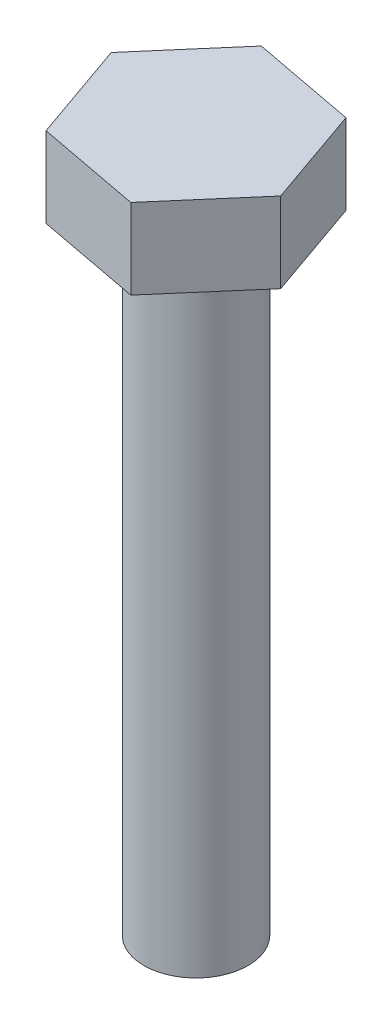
ISO-10303-21;
HEADER;
FILE_DESCRIPTION(('STEP AP214'),'2;1');
FILE_NAME('part.step','',(''),(''),'','','');
FILE_SCHEMA(('AUTOMOTIVE_DESIGN { 1 0 10303 214 1 1 1 1 }'));
ENDSEC;
DATA;
#1=APPLICATION_CONTEXT('core data for automotive mechanical design processes');
#2=APPLICATION_PROTOCOL_DEFINITION('international standard','automotive_design',2000,#1);
#3=PRODUCT_CONTEXT('',#1,'mechanical');
#4=PRODUCT('Part','Part','',(#3));
#5=PRODUCT_RELATED_PRODUCT_CATEGORY('part','',(#4));
#6=PRODUCT_DEFINITION_FORMATION('','',#4);
#7=PRODUCT_DEFINITION_CONTEXT('part definition',#1,'design');
#8=PRODUCT_DEFINITION('design','',#6,#7);
#9=PRODUCT_DEFINITION_SHAPE('','',#8);
#10=(LENGTH_UNIT() NAMED_UNIT(*) SI_UNIT(.MILLI.,.METRE.));
#11=(NAMED_UNIT(*) PLANE_ANGLE_UNIT() SI_UNIT($,.RADIAN.));
#12=(NAMED_UNIT(*) SI_UNIT($,.STERADIAN.) SOLID_ANGLE_UNIT());
#13=UNCERTAINTY_MEASURE_WITH_UNIT(LENGTH_MEASURE(1.E-05),#10,'distance_accuracy_value','');
#14=(GEOMETRIC_REPRESENTATION_CONTEXT(3) GLOBAL_UNCERTAINTY_ASSIGNED_CONTEXT((#13)) GLOBAL_UNIT_ASSIGNED_CONTEXT((#10,
#11,#12)) REPRESENTATION_CONTEXT('',''));
#15=CARTESIAN_POINT('',(0.,0.,0.));
#16=DIRECTION('',(0.,0.,1.));
#17=DIRECTION('',(1.,0.,0.));
#18=AXIS2_PLACEMENT_3D('',#15,#16,#17);
#19=CARTESIAN_POINT('',(0.,39.37,0.));
#20=DIRECTION('',(0.,1.,0.));
#21=DIRECTION('',(0.,0.,1.));
#22=AXIS2_PLACEMENT_3D('',#19,#20,#21);
#23=PLANE('',#22);
#24=DIRECTION('',(0.652264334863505,0.,-0.757991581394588));
#25=VECTOR('',#24,1.);
#26=CARTESIAN_POINT('',(-41.4810541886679,39.37,110.829527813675));
#27=LINE('',#26,#25);
#28=CARTESIAN_POINT('',(-41.4810541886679,39.37,110.829527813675));
#29=VERTEX_POINT('',#28);
#30=CARTESIAN_POINT('',(-37.0928819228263,39.37,105.730065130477));
#31=VERTEX_POINT('',#30);
#32=EDGE_CURVE('E119',#29,#31,#27,.T.);
#33=ORIENTED_EDGE('',*,*,#32,.F.);
#34=DIRECTION('',(0.982572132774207,0.,0.185881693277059));
#35=VECTOR('',#34,1.);
#36=CARTESIAN_POINT('',(-48.0914045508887,39.37,109.578990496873));
#37=LINE('',#36,#35);
#38=CARTESIAN_POINT('',(-48.0914045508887,39.37,109.578990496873));
#39=VERTEX_POINT('',#38);
#40=EDGE_CURVE('E79',#39,#29,#37,.T.);
#41=ORIENTED_EDGE('',*,*,#40,.F.);
#42=DIRECTION('',(0.330307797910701,0.,0.94387327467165));
#43=VECTOR('',#42,1.);
#44=CARTESIAN_POINT('',(-50.3135826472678,39.37,103.228990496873));
#45=LINE('',#44,#43);
#46=CARTESIAN_POINT('',(-50.3135826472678,39.37,103.228990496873));
#47=VERTEX_POINT('',#46);
#48=EDGE_CURVE('E73',#47,#39,#45,.T.);
#49=ORIENTED_EDGE('',*,*,#48,.F.);
#50=DIRECTION('',(-0.652264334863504,0.,0.757991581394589));
#51=VECTOR('',#50,1.);
#52=CARTESIAN_POINT('',(-45.9254103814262,39.37,98.1295278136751));
#53=LINE('',#52,#51);
#54=CARTESIAN_POINT('',(-45.9254103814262,39.37,98.1295278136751));
#55=VERTEX_POINT('',#54);
#56=EDGE_CURVE('E109',#55,#47,#53,.T.);
#57=ORIENTED_EDGE('',*,*,#56,.F.);
#58=DIRECTION('',(-0.982572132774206,0.,-0.185881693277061));
#59=VECTOR('',#58,1.);
#60=CARTESIAN_POINT('',(-39.3150600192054,39.37,99.3800651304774));
#61=LINE('',#60,#59);
#62=CARTESIAN_POINT('',(-39.3150600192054,39.37,99.3800651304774));
#63=VERTEX_POINT('',#62);
#64=EDGE_CURVE('E125',#63,#55,#61,.T.);
#65=ORIENTED_EDGE('',*,*,#64,.F.);
#66=DIRECTION('',(-0.330307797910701,0.,-0.94387327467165));
#67=VECTOR('',#66,1.);
#68=CARTESIAN_POINT('',(-37.0928819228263,39.37,105.730065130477));
#69=LINE('',#68,#67);
#70=EDGE_CURVE('E122',#31,#63,#69,.T.);
#71=ORIENTED_EDGE('',*,*,#70,.F.);
#72=EDGE_LOOP('',(#33,#41,#49,#57,#65,#71));
#73=FACE_BOUND('',#72,.T.);
#74=CARTESIAN_POINT('',(-43.7032322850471,39.37,104.479527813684));
#75=DIRECTION('',(0.,1.,0.));
#76=DIRECTION('',(0.,0.,1.));
#77=AXIS2_PLACEMENT_3D('',#74,#75,#76);
#78=CIRCLE('',#77,3.30000000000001);
#79=CARTESIAN_POINT('',(-43.7032322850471,39.37,107.779527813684));
#80=VERTEX_POINT('',#79);
#81=EDGE_CURVE('E11',#80,#80,#78,.F.);
#82=ORIENTED_EDGE('',*,*,#81,.F.);
#83=EDGE_LOOP('',(#82));
#84=FACE_BOUND('',#83,.T.);
#85=ADVANCED_FACE('F33',(#73,#84),#23,.F.);
#86=CARTESIAN_POINT('',(-41.4810541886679,44.45,110.829527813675));
#87=DIRECTION('',(-0.757991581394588,0.,-0.652264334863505));
#88=DIRECTION('',(-0.652264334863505,0.,0.757991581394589));
#89=AXIS2_PLACEMENT_3D('',#86,#87,#88);
#90=PLANE('',#89);
#91=ORIENTED_EDGE('',*,*,#32,.T.);
#92=DIRECTION('',(0.,-1.,0.));
#93=VECTOR('',#92,1.);
#94=CARTESIAN_POINT('',(-37.0928819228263,44.45,105.730065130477));
#95=LINE('',#94,#93);
#96=CARTESIAN_POINT('',(-37.0928819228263,44.45,105.730065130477));
#97=VERTEX_POINT('',#96);
#98=EDGE_CURVE('E42',#97,#31,#95,.T.);
#99=ORIENTED_EDGE('',*,*,#98,.F.);
#100=DIRECTION('',(0.652264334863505,0.,-0.757991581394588));
#101=VECTOR('',#100,1.);
#102=CARTESIAN_POINT('',(-41.4810541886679,44.45,110.829527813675));
#103=LINE('',#102,#101);
#104=CARTESIAN_POINT('',(-41.4810541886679,44.45,110.829527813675));
#105=VERTEX_POINT('',#104);
#106=EDGE_CURVE('E130',#105,#97,#103,.T.);
#107=ORIENTED_EDGE('',*,*,#106,.F.);
#108=DIRECTION('',(0.,-1.,0.));
#109=VECTOR('',#108,1.);
#110=CARTESIAN_POINT('',(-41.4810541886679,44.45,110.829527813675));
#111=LINE('',#110,#109);
#112=EDGE_CURVE('E115',#105,#29,#111,.T.);
#113=ORIENTED_EDGE('',*,*,#112,.T.);
#114=EDGE_LOOP('',(#91,#99,#107,#113));
#115=FACE_BOUND('',#114,.T.);
#116=ADVANCED_FACE('F35',(#115),#90,.F.);
#117=CARTESIAN_POINT('',(-37.0928819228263,44.45,105.730065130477));
#118=DIRECTION('',(-0.94387327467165,0.,0.330307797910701));
#119=DIRECTION('',(0.330307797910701,0.,0.94387327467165));
#120=AXIS2_PLACEMENT_3D('',#117,#118,#119);
#121=PLANE('',#120);
#122=ORIENTED_EDGE('',*,*,#70,.T.);
#123=DIRECTION('',(0.,-1.,0.));
#124=VECTOR('',#123,1.);
#125=CARTESIAN_POINT('',(-39.3150600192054,44.45,99.3800651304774));
#126=LINE('',#125,#124);
#127=CARTESIAN_POINT('',(-39.3150600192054,44.45,99.3800651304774));
#128=VERTEX_POINT('',#127);
#129=EDGE_CURVE('E134',#128,#63,#126,.T.);
#130=ORIENTED_EDGE('',*,*,#129,.F.);
#131=DIRECTION('',(-0.330307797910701,0.,-0.94387327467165));
#132=VECTOR('',#131,1.);
#133=CARTESIAN_POINT('',(-37.0928819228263,44.45,105.730065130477));
#134=LINE('',#133,#132);
#135=EDGE_CURVE('E88',#97,#128,#134,.T.);
#136=ORIENTED_EDGE('',*,*,#135,.F.);
#137=ORIENTED_EDGE('',*,*,#98,.T.);
#138=EDGE_LOOP('',(#122,#130,#136,#137));
#139=FACE_BOUND('',#138,.T.);
#140=ADVANCED_FACE('F137',(#139),#121,.F.);
#141=CARTESIAN_POINT('',(-39.3150600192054,44.45,99.3800651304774));
#142=DIRECTION('',(-0.185881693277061,0.,0.982572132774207));
#143=DIRECTION('',(0.982572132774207,0.,0.185881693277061));
#144=AXIS2_PLACEMENT_3D('',#141,#142,#143);
#145=PLANE('',#144);
#146=ORIENTED_EDGE('',*,*,#64,.T.);
#147=DIRECTION('',(0.,-1.,0.));
#148=VECTOR('',#147,1.);
#149=CARTESIAN_POINT('',(-45.9254103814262,44.45,98.1295278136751));
#150=LINE('',#149,#148);
#151=CARTESIAN_POINT('',(-45.9254103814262,44.45,98.1295278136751));
#152=VERTEX_POINT('',#151);
#153=EDGE_CURVE('E110',#152,#55,#150,.T.);
#154=ORIENTED_EDGE('',*,*,#153,.F.);
#155=DIRECTION('',(-0.982572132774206,0.,-0.185881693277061));
#156=VECTOR('',#155,1.);
#157=CARTESIAN_POINT('',(-39.3150600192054,44.45,99.3800651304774));
#158=LINE('',#157,#156);
#159=EDGE_CURVE('E101',#128,#152,#158,.T.);
#160=ORIENTED_EDGE('',*,*,#159,.F.);
#161=ORIENTED_EDGE('',*,*,#129,.T.);
#162=EDGE_LOOP('',(#146,#154,#160,#161));
#163=FACE_BOUND('',#162,.T.);
#164=ADVANCED_FACE('F145',(#163),#145,.F.);
#165=CARTESIAN_POINT('',(-45.9254103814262,44.45,98.1295278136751));
#166=DIRECTION('',(0.757991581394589,0.,0.652264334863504));
#167=DIRECTION('',(0.652264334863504,0.,-0.757991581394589));
#168=AXIS2_PLACEMENT_3D('',#165,#166,#167);
#169=PLANE('',#168);
#170=ORIENTED_EDGE('',*,*,#56,.T.);
#171=DIRECTION('',(0.,-1.,0.));
#172=VECTOR('',#171,1.);
#173=CARTESIAN_POINT('',(-50.3135826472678,44.45,103.228990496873));
#174=LINE('',#173,#172);
#175=CARTESIAN_POINT('',(-50.3135826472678,44.45,103.228990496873));
#176=VERTEX_POINT('',#175);
#177=EDGE_CURVE('E106',#176,#47,#174,.T.);
#178=ORIENTED_EDGE('',*,*,#177,.F.);
#179=DIRECTION('',(-0.652264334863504,0.,0.757991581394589));
#180=VECTOR('',#179,1.);
#181=CARTESIAN_POINT('',(-45.9254103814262,44.45,98.1295278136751));
#182=LINE('',#181,#180);
#183=EDGE_CURVE('E95',#152,#176,#182,.T.);
#184=ORIENTED_EDGE('',*,*,#183,.F.);
#185=ORIENTED_EDGE('',*,*,#153,.T.);
#186=EDGE_LOOP('',(#170,#178,#184,#185));
#187=FACE_BOUND('',#186,.T.);
#188=ADVANCED_FACE('F107',(#187),#169,.F.);
#189=CARTESIAN_POINT('',(-50.3135826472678,44.45,103.228990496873));
#190=DIRECTION('',(0.94387327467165,0.,-0.330307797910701));
#191=DIRECTION('',(-0.330307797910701,0.,-0.94387327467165));
#192=AXIS2_PLACEMENT_3D('',#189,#190,#191);
#193=PLANE('',#192);
#194=ORIENTED_EDGE('',*,*,#48,.T.);
#195=DIRECTION('',(0.,-1.,0.));
#196=VECTOR('',#195,1.);
#197=CARTESIAN_POINT('',(-48.0914045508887,44.45,109.578990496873));
#198=LINE('',#197,#196);
#199=CARTESIAN_POINT('',(-48.0914045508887,44.45,109.578990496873));
#200=VERTEX_POINT('',#199);
#201=EDGE_CURVE('E111',#200,#39,#198,.T.);
#202=ORIENTED_EDGE('',*,*,#201,.F.);
#203=DIRECTION('',(0.330307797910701,0.,0.94387327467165));
#204=VECTOR('',#203,1.);
#205=CARTESIAN_POINT('',(-50.3135826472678,44.45,103.228990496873));
#206=LINE('',#205,#204);
#207=EDGE_CURVE('E99',#176,#200,#206,.T.);
#208=ORIENTED_EDGE('',*,*,#207,.F.);
#209=ORIENTED_EDGE('',*,*,#177,.T.);
#210=EDGE_LOOP('',(#194,#202,#208,#209));
#211=FACE_BOUND('',#210,.T.);
#212=ADVANCED_FACE('F113',(#211),#193,.F.);
#213=CARTESIAN_POINT('',(-48.0914045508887,44.45,109.578990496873));
#214=DIRECTION('',(0.185881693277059,0.,-0.982572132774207));
#215=DIRECTION('',(-0.982572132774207,0.,-0.185881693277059));
#216=AXIS2_PLACEMENT_3D('',#213,#214,#215);
#217=PLANE('',#216);
#218=ORIENTED_EDGE('',*,*,#40,.T.);
#219=ORIENTED_EDGE('',*,*,#112,.F.);
#220=DIRECTION('',(0.982572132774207,0.,0.185881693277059));
#221=VECTOR('',#220,1.);
#222=CARTESIAN_POINT('',(-48.0914045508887,44.45,109.578990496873));
#223=LINE('',#222,#221);
#224=EDGE_CURVE('E50',#200,#105,#223,.T.);
#225=ORIENTED_EDGE('',*,*,#224,.F.);
#226=ORIENTED_EDGE('',*,*,#201,.T.);
#227=EDGE_LOOP('',(#218,#219,#225,#226));
#228=FACE_BOUND('',#227,.T.);
#229=ADVANCED_FACE('F169',(#228),#217,.F.);
#230=CARTESIAN_POINT('',(0.,44.45,0.));
#231=DIRECTION('',(0.,1.,0.));
#232=DIRECTION('',(0.,0.,1.));
#233=AXIS2_PLACEMENT_3D('',#230,#231,#232);
#234=PLANE('',#233);
#235=ORIENTED_EDGE('',*,*,#106,.T.);
#236=ORIENTED_EDGE('',*,*,#135,.T.);
#237=ORIENTED_EDGE('',*,*,#159,.T.);
#238=ORIENTED_EDGE('',*,*,#183,.T.);
#239=ORIENTED_EDGE('',*,*,#207,.T.);
#240=ORIENTED_EDGE('',*,*,#224,.T.);
#241=EDGE_LOOP('',(#235,#236,#237,#238,#239,#240));
#242=FACE_BOUND('',#241,.T.);
#243=ADVANCED_FACE('F97',(#242),#234,.T.);
#244=CARTESIAN_POINT('',(-43.7032322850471,-9.33380951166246,104.479527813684));
#245=DIRECTION('',(0.,1.,0.));
#246=DIRECTION('',(0.,0.,1.));
#247=AXIS2_PLACEMENT_3D('',#244,#245,#246);
#248=CYLINDRICAL_SURFACE('',#247,3.30000000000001);
#249=CARTESIAN_POINT('',(-43.7032322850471,0.,104.479527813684));
#250=DIRECTION('',(0.,1.,0.));
#251=DIRECTION('',(0.,0.,1.));
#252=AXIS2_PLACEMENT_3D('',#249,#250,#251);
#253=CIRCLE('',#252,3.30000000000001);
#254=CARTESIAN_POINT('',(-43.7032322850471,0.,107.779527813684));
#255=VERTEX_POINT('',#254);
#256=EDGE_CURVE('E123',#255,#255,#253,.T.);
#257=ORIENTED_EDGE('',*,*,#256,.T.);
#258=EDGE_LOOP('',(#257));
#259=FACE_BOUND('',#258,.T.);
#260=ORIENTED_EDGE('',*,*,#81,.T.);
#261=EDGE_LOOP('',(#260));
#262=FACE_BOUND('',#261,.T.);
#263=ADVANCED_FACE('F152',(#259,#262),#248,.T.);
#264=CARTESIAN_POINT('',(73.3685899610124,0.,48.3753281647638));
#265=DIRECTION('',(0.,1.,0.));
#266=DIRECTION('',(0.,0.,-1.));
#267=AXIS2_PLACEMENT_3D('',#264,#265,#266);
#268=PLANE('',#267);
#269=ORIENTED_EDGE('',*,*,#256,.F.);
#270=EDGE_LOOP('',(#269));
#271=FACE_BOUND('',#270,.T.);
#272=ADVANCED_FACE('F155',(#271),#268,.F.);
#273=CLOSED_SHELL('',(#85,#116,#140,#164,#188,#212,#229,#243,#263,#272));
#274=MANIFOLD_SOLID_BREP('B2',#273);
#275=ADVANCED_BREP_SHAPE_REPRESENTATION('',(#18,#274),#14);
#276=SHAPE_DEFINITION_REPRESENTATION(#9,#275);
ENDSEC;
END-ISO-10303-21;
